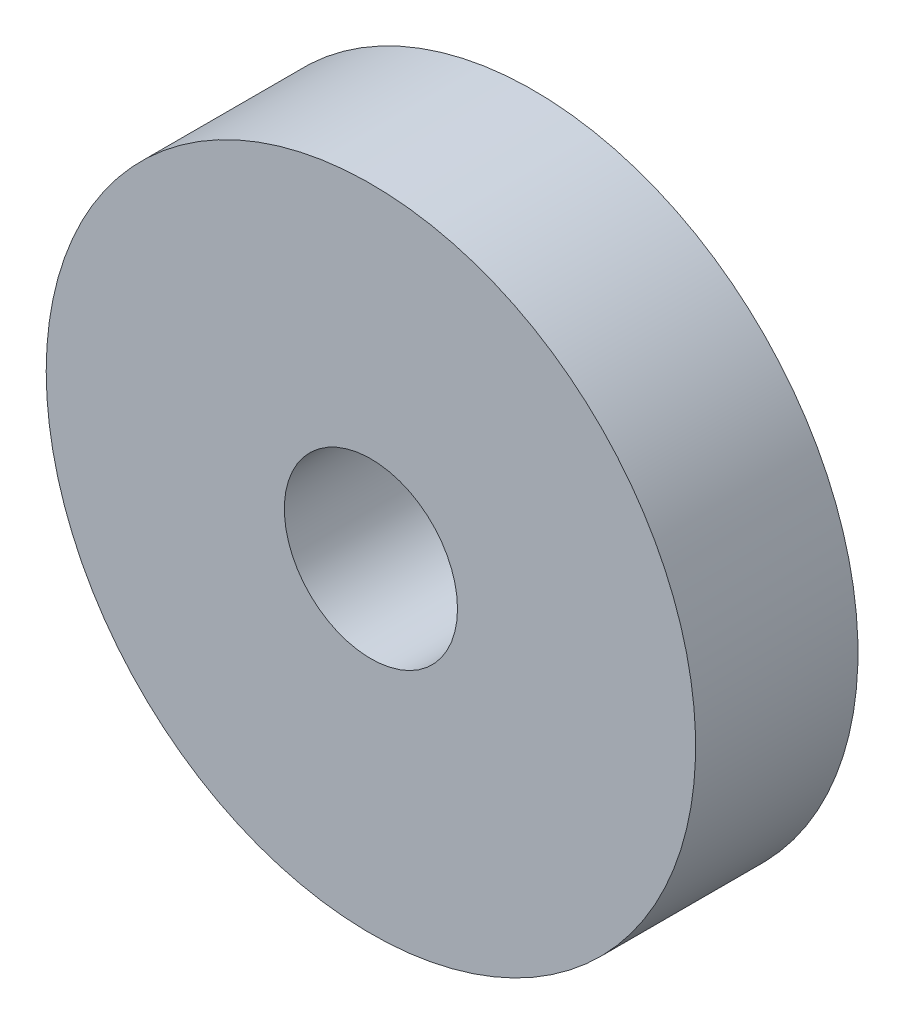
ISO-10303-21;
HEADER;
FILE_DESCRIPTION(('STEP AP214'),'2;1');
FILE_NAME('part.step','',(''),(''),'','','');
FILE_SCHEMA(('AUTOMOTIVE_DESIGN { 1 0 10303 214 1 1 1 1 }'));
ENDSEC;
DATA;
#1=APPLICATION_CONTEXT('core data for automotive mechanical design processes');
#2=APPLICATION_PROTOCOL_DEFINITION('international standard','automotive_design',2000,#1);
#3=PRODUCT_CONTEXT('',#1,'mechanical');
#4=PRODUCT('Part','Part','',(#3));
#5=PRODUCT_RELATED_PRODUCT_CATEGORY('part','',(#4));
#6=PRODUCT_DEFINITION_FORMATION('','',#4);
#7=PRODUCT_DEFINITION_CONTEXT('part definition',#1,'design');
#8=PRODUCT_DEFINITION('design','',#6,#7);
#9=PRODUCT_DEFINITION_SHAPE('','',#8);
#10=(LENGTH_UNIT() NAMED_UNIT(*) SI_UNIT(.MILLI.,.METRE.));
#11=(NAMED_UNIT(*) PLANE_ANGLE_UNIT() SI_UNIT($,.RADIAN.));
#12=(NAMED_UNIT(*) SI_UNIT($,.STERADIAN.) SOLID_ANGLE_UNIT());
#13=UNCERTAINTY_MEASURE_WITH_UNIT(LENGTH_MEASURE(1.E-05),#10,'distance_accuracy_value','');
#14=(GEOMETRIC_REPRESENTATION_CONTEXT(3) GLOBAL_UNCERTAINTY_ASSIGNED_CONTEXT((#13)) GLOBAL_UNIT_ASSIGNED_CONTEXT((#10,
#11,#12)) REPRESENTATION_CONTEXT('',''));
#15=CARTESIAN_POINT('',(0.,0.,0.));
#16=DIRECTION('',(0.,0.,1.));
#17=DIRECTION('',(1.,0.,0.));
#18=AXIS2_PLACEMENT_3D('',#15,#16,#17);
#19=CARTESIAN_POINT('',(0.,0.,4.7625));
#20=DIRECTION('',(0.,0.,-1.));
#21=DIRECTION('',(-1.,0.,0.));
#22=AXIS2_PLACEMENT_3D('',#19,#20,#21);
#23=CYLINDRICAL_SURFACE('',#22,9.525);
#24=CARTESIAN_POINT('',(0.,0.,4.7625));
#25=DIRECTION('',(0.,0.,1.));
#26=DIRECTION('',(1.,0.,0.));
#27=AXIS2_PLACEMENT_3D('',#24,#25,#26);
#28=CIRCLE('',#27,9.525);
#29=CARTESIAN_POINT('',(-9.525,0.,4.7625));
#30=VERTEX_POINT('',#29);
#31=EDGE_CURVE('E10',#30,#30,#28,.T.);
#32=CARTESIAN_POINT('',(0.,0.,0.));
#33=DIRECTION('',(0.,0.,1.));
#34=DIRECTION('',(1.,0.,0.));
#35=AXIS2_PLACEMENT_3D('',#32,#33,#34);
#36=CIRCLE('',#35,9.525);
#37=CARTESIAN_POINT('',(-9.525,0.,0.));
#38=VERTEX_POINT('',#37);
#39=EDGE_CURVE('E40',#38,#38,#36,.T.);
#40=CARTESIAN_POINT('',(-9.525,0.,4.7625));
#41=CARTESIAN_POINT('',(-9.525,0.,4.712890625));
#42=CARTESIAN_POINT('',(-9.525,0.,4.66328125));
#43=CARTESIAN_POINT('',(-9.525,0.,4.5640625));
#44=CARTESIAN_POINT('',(-9.525,0.,4.514453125));
#45=CARTESIAN_POINT('',(-9.525,0.,4.415234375));
#46=CARTESIAN_POINT('',(-9.525,0.,4.365625));
#47=CARTESIAN_POINT('',(-9.525,0.,4.26640625));
#48=CARTESIAN_POINT('',(-9.525,0.,4.216796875));
#49=CARTESIAN_POINT('',(-9.525,0.,4.117578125));
#50=CARTESIAN_POINT('',(-9.525,0.,4.06796875));
#51=CARTESIAN_POINT('',(-9.525,0.,3.96875));
#52=CARTESIAN_POINT('',(-9.525,0.,3.919140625));
#53=CARTESIAN_POINT('',(-9.525,0.,3.819921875));
#54=CARTESIAN_POINT('',(-9.525,0.,3.7703125));
#55=CARTESIAN_POINT('',(-9.525,0.,3.67109375));
#56=CARTESIAN_POINT('',(-9.525,0.,3.621484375));
#57=CARTESIAN_POINT('',(-9.525,0.,3.522265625));
#58=CARTESIAN_POINT('',(-9.525,0.,3.47265625));
#59=CARTESIAN_POINT('',(-9.525,0.,3.3734375));
#60=CARTESIAN_POINT('',(-9.525,0.,3.323828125));
#61=CARTESIAN_POINT('',(-9.525,0.,3.224609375));
#62=CARTESIAN_POINT('',(-9.525,0.,3.175));
#63=CARTESIAN_POINT('',(-9.525,0.,3.07578125));
#64=CARTESIAN_POINT('',(-9.525,0.,3.026171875));
#65=CARTESIAN_POINT('',(-9.525,0.,2.926953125));
#66=CARTESIAN_POINT('',(-9.525,0.,2.87734375));
#67=CARTESIAN_POINT('',(-9.525,0.,2.778125));
#68=CARTESIAN_POINT('',(-9.525,0.,2.728515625));
#69=CARTESIAN_POINT('',(-9.525,0.,2.629296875));
#70=CARTESIAN_POINT('',(-9.525,0.,2.5796875));
#71=CARTESIAN_POINT('',(-9.525,0.,2.48046875));
#72=CARTESIAN_POINT('',(-9.525,0.,2.430859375));
#73=CARTESIAN_POINT('',(-9.525,0.,2.331640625));
#74=CARTESIAN_POINT('',(-9.525,0.,2.28203125));
#75=CARTESIAN_POINT('',(-9.525,0.,2.1828125));
#76=CARTESIAN_POINT('',(-9.525,0.,2.133203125));
#77=CARTESIAN_POINT('',(-9.525,0.,2.033984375));
#78=CARTESIAN_POINT('',(-9.525,0.,1.984375));
#79=CARTESIAN_POINT('',(-9.525,0.,1.88515625));
#80=CARTESIAN_POINT('',(-9.525,0.,1.835546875));
#81=CARTESIAN_POINT('',(-9.525,0.,1.736328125));
#82=CARTESIAN_POINT('',(-9.525,0.,1.68671875));
#83=CARTESIAN_POINT('',(-9.525,0.,1.5875));
#84=CARTESIAN_POINT('',(-9.525,0.,1.537890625));
#85=CARTESIAN_POINT('',(-9.525,0.,1.438671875));
#86=CARTESIAN_POINT('',(-9.525,0.,1.3890625));
#87=CARTESIAN_POINT('',(-9.525,0.,1.28984375));
#88=CARTESIAN_POINT('',(-9.525,0.,1.240234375));
#89=CARTESIAN_POINT('',(-9.525,0.,1.141015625));
#90=CARTESIAN_POINT('',(-9.525,0.,1.09140625));
#91=CARTESIAN_POINT('',(-9.525,0.,0.992187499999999));
#92=CARTESIAN_POINT('',(-9.525,0.,0.942578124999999));
#93=CARTESIAN_POINT('',(-9.525,0.,0.843359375));
#94=CARTESIAN_POINT('',(-9.525,0.,0.79375));
#95=CARTESIAN_POINT('',(-9.525,0.,0.69453125));
#96=CARTESIAN_POINT('',(-9.525,0.,0.644921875));
#97=CARTESIAN_POINT('',(-9.525,0.,0.545703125));
#98=CARTESIAN_POINT('',(-9.525,0.,0.49609375));
#99=CARTESIAN_POINT('',(-9.525,0.,0.396875));
#100=CARTESIAN_POINT('',(-9.525,0.,0.347265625));
#101=CARTESIAN_POINT('',(-9.525,0.,0.248046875));
#102=CARTESIAN_POINT('',(-9.525,0.,0.1984375));
#103=CARTESIAN_POINT('',(-9.525,0.,0.09921875));
#104=CARTESIAN_POINT('',(-9.525,0.,0.049609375));
#105=CARTESIAN_POINT('',(-9.525,0.,0.));
#106=B_SPLINE_CURVE_WITH_KNOTS('',3,(#40,#41,#42,#43,#44,#45,#46,#47,#48,#49,#50,#51,#52,#53,
#54,#55,#56,#57,#58,#59,#60,#61,#62,#63,#64,#65,#66,#67,#68,#69,#70,#71,#72,#73,#74,#75,#76,#77,
#78,#79,#80,#81,#82,#83,#84,#85,#86,#87,#88,#89,#90,#91,#92,#93,#94,#95,#96,#97,#98,#99,#100,
#101,#102,#103,#104,#105),.UNSPECIFIED.,.F.,.F.,(4,2,2,2,2,2,2,2,2,2,2,2,2,2,2,2,2,2,2,2,2,2,2,
2,2,2,2,2,2,2,2,2,4),(0.,0.148828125,0.29765625,0.446484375,0.5953125,0.744140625,
0.892968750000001,1.041796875,1.190625,1.339453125,1.48828125,1.637109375,1.7859375,1.934765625,
2.08359375,2.232421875,2.38125,2.530078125,2.67890625,2.827734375,2.9765625,3.125390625,
3.27421875,3.423046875,3.571875,3.720703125,3.86953125,4.018359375,4.1671875,4.316015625,
4.46484375,4.613671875,4.7625),.UNSPECIFIED.);
#107=EDGE_CURVE('BSEAM37',#30,#38,#106,.T.);
#108=ORIENTED_EDGE('',*,*,#31,.F.);
#109=ORIENTED_EDGE('',*,*,#39,.T.);
#110=ORIENTED_EDGE('',*,*,#107,.T.);
#111=ORIENTED_EDGE('',*,*,#107,.F.);
#112=EDGE_LOOP('',(#108,#110,#109,#111));
#113=FACE_BOUND('',#112,.T.);
#114=ADVANCED_FACE('F37',(#113),#23,.T.);
#115=CARTESIAN_POINT('',(0.,0.,4.7625));
#116=DIRECTION('',(0.,0.,1.));
#117=DIRECTION('',(1.,0.,0.));
#118=AXIS2_PLACEMENT_3D('',#115,#116,#117);
#119=PLANE('',#118);
#120=CARTESIAN_POINT('',(0.,0.,4.7625));
#121=DIRECTION('',(0.,0.,1.));
#122=DIRECTION('',(1.,0.,0.));
#123=AXIS2_PLACEMENT_3D('',#120,#121,#122);
#124=CIRCLE('',#123,2.54);
#125=CARTESIAN_POINT('',(2.54,0.,4.7625));
#126=VERTEX_POINT('',#125);
#127=EDGE_CURVE('E49',#126,#126,#124,.T.);
#128=ORIENTED_EDGE('',*,*,#127,.F.);
#129=EDGE_LOOP('',(#128));
#130=FACE_BOUND('',#129,.T.);
#131=ORIENTED_EDGE('',*,*,#31,.T.);
#132=EDGE_LOOP('',(#131));
#133=FACE_BOUND('',#132,.T.);
#134=ADVANCED_FACE('F64',(#130,#133),#119,.T.);
#135=CARTESIAN_POINT('',(0.,0.,0.));
#136=DIRECTION('',(0.,0.,1.));
#137=DIRECTION('',(1.,0.,0.));
#138=AXIS2_PLACEMENT_3D('',#135,#136,#137);
#139=PLANE('',#138);
#140=CARTESIAN_POINT('',(0.,0.,0.));
#141=DIRECTION('',(0.,0.,1.));
#142=DIRECTION('',(1.,0.,0.));
#143=AXIS2_PLACEMENT_3D('',#140,#141,#142);
#144=CIRCLE('',#143,2.54);
#145=CARTESIAN_POINT('',(2.54,0.,0.));
#146=VERTEX_POINT('',#145);
#147=EDGE_CURVE('E47',#146,#146,#144,.T.);
#148=ORIENTED_EDGE('',*,*,#147,.T.);
#149=EDGE_LOOP('',(#148));
#150=FACE_BOUND('',#149,.T.);
#151=ORIENTED_EDGE('',*,*,#39,.F.);
#152=EDGE_LOOP('',(#151));
#153=FACE_BOUND('',#152,.T.);
#154=ADVANCED_FACE('F55',(#150,#153),#139,.F.);
#155=CARTESIAN_POINT('',(0.,0.,0.));
#156=DIRECTION('',(0.,0.,1.));
#157=DIRECTION('',(1.,0.,0.));
#158=AXIS2_PLACEMENT_3D('',#155,#156,#157);
#159=CYLINDRICAL_SURFACE('',#158,2.54);
#160=CARTESIAN_POINT('',(2.54,0.,0.));
#161=CARTESIAN_POINT('',(2.54,0.,0.049609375));
#162=CARTESIAN_POINT('',(2.54,0.,0.09921875));
#163=CARTESIAN_POINT('',(2.54,0.,0.1984375));
#164=CARTESIAN_POINT('',(2.54,0.,0.248046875));
#165=CARTESIAN_POINT('',(2.54,0.,0.347265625));
#166=CARTESIAN_POINT('',(2.54,0.,0.396875));
#167=CARTESIAN_POINT('',(2.54,0.,0.49609375));
#168=CARTESIAN_POINT('',(2.54,0.,0.545703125));
#169=CARTESIAN_POINT('',(2.54,0.,0.644921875));
#170=CARTESIAN_POINT('',(2.54,0.,0.69453125));
#171=CARTESIAN_POINT('',(2.54,0.,0.79375));
#172=CARTESIAN_POINT('',(2.54,0.,0.843359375));
#173=CARTESIAN_POINT('',(2.54,0.,0.942578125));
#174=CARTESIAN_POINT('',(2.54,0.,0.9921875));
#175=CARTESIAN_POINT('',(2.54,0.,1.09140625));
#176=CARTESIAN_POINT('',(2.54,0.,1.141015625));
#177=CARTESIAN_POINT('',(2.54,0.,1.240234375));
#178=CARTESIAN_POINT('',(2.54,0.,1.28984375));
#179=CARTESIAN_POINT('',(2.54,0.,1.3890625));
#180=CARTESIAN_POINT('',(2.54,0.,1.438671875));
#181=CARTESIAN_POINT('',(2.54,0.,1.537890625));
#182=CARTESIAN_POINT('',(2.54,0.,1.5875));
#183=CARTESIAN_POINT('',(2.54,0.,1.68671875));
#184=CARTESIAN_POINT('',(2.54,0.,1.736328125));
#185=CARTESIAN_POINT('',(2.54,0.,1.835546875));
#186=CARTESIAN_POINT('',(2.54,0.,1.88515625));
#187=CARTESIAN_POINT('',(2.54,0.,1.984375));
#188=CARTESIAN_POINT('',(2.54,0.,2.033984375));
#189=CARTESIAN_POINT('',(2.54,0.,2.133203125));
#190=CARTESIAN_POINT('',(2.54,0.,2.1828125));
#191=CARTESIAN_POINT('',(2.54,0.,2.28203125));
#192=CARTESIAN_POINT('',(2.54,0.,2.331640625));
#193=CARTESIAN_POINT('',(2.54,0.,2.430859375));
#194=CARTESIAN_POINT('',(2.54,0.,2.48046875));
#195=CARTESIAN_POINT('',(2.54,0.,2.5796875));
#196=CARTESIAN_POINT('',(2.54,0.,2.629296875));
#197=CARTESIAN_POINT('',(2.54,0.,2.728515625));
#198=CARTESIAN_POINT('',(2.54,0.,2.778125));
#199=CARTESIAN_POINT('',(2.54,0.,2.87734375));
#200=CARTESIAN_POINT('',(2.54,0.,2.926953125));
#201=CARTESIAN_POINT('',(2.54,0.,3.026171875));
#202=CARTESIAN_POINT('',(2.54,0.,3.07578125));
#203=CARTESIAN_POINT('',(2.54,0.,3.175));
#204=CARTESIAN_POINT('',(2.54,0.,3.224609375));
#205=CARTESIAN_POINT('',(2.54,0.,3.323828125));
#206=CARTESIAN_POINT('',(2.54,0.,3.3734375));
#207=CARTESIAN_POINT('',(2.54,0.,3.47265625));
#208=CARTESIAN_POINT('',(2.54,0.,3.522265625));
#209=CARTESIAN_POINT('',(2.54,0.,3.621484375));
#210=CARTESIAN_POINT('',(2.54,0.,3.67109375));
#211=CARTESIAN_POINT('',(2.54,0.,3.7703125));
#212=CARTESIAN_POINT('',(2.54,0.,3.819921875));
#213=CARTESIAN_POINT('',(2.54,0.,3.919140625));
#214=CARTESIAN_POINT('',(2.54,0.,3.96875));
#215=CARTESIAN_POINT('',(2.54,0.,4.06796875));
#216=CARTESIAN_POINT('',(2.54,0.,4.117578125));
#217=CARTESIAN_POINT('',(2.54,0.,4.216796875));
#218=CARTESIAN_POINT('',(2.54,0.,4.26640625));
#219=CARTESIAN_POINT('',(2.54,0.,4.365625));
#220=CARTESIAN_POINT('',(2.54,0.,4.415234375));
#221=CARTESIAN_POINT('',(2.54,0.,4.514453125));
#222=CARTESIAN_POINT('',(2.54,0.,4.5640625));
#223=CARTESIAN_POINT('',(2.54,0.,4.66328125));
#224=CARTESIAN_POINT('',(2.54,0.,4.712890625));
#225=CARTESIAN_POINT('',(2.54,0.,4.7625));
#226=B_SPLINE_CURVE_WITH_KNOTS('',3,(#160,#161,#162,#163,#164,#165,#166,#167,#168,#169,#170,
#171,#172,#173,#174,#175,#176,#177,#178,#179,#180,#181,#182,#183,#184,#185,#186,#187,#188,#189,
#190,#191,#192,#193,#194,#195,#196,#197,#198,#199,#200,#201,#202,#203,#204,#205,#206,#207,#208,
#209,#210,#211,#212,#213,#214,#215,#216,#217,#218,#219,#220,#221,#222,#223,#224,#225),
.UNSPECIFIED.,.F.,.F.,(4,2,2,2,2,2,2,2,2,2,2,2,2,2,2,2,2,2,2,2,2,2,2,2,2,2,2,2,2,2,2,2,4),(0.,
0.148828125,0.29765625,0.446484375,0.5953125,0.744140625,0.89296875,1.041796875,1.190625,
1.339453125,1.48828125,1.637109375,1.7859375,1.934765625,2.08359375,2.232421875,2.38125,
2.530078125,2.67890625,2.827734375,2.9765625,3.125390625,3.27421875,3.423046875,3.571875,
3.720703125,3.86953125,4.018359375,4.1671875,4.316015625,4.46484375,4.613671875,4.7625),.UNSPECIFIED.);
#227=EDGE_CURVE('BSEAM58',#146,#126,#226,.T.);
#228=ORIENTED_EDGE('',*,*,#147,.F.);
#229=ORIENTED_EDGE('',*,*,#127,.T.);
#230=ORIENTED_EDGE('',*,*,#227,.T.);
#231=ORIENTED_EDGE('',*,*,#227,.F.);
#232=EDGE_LOOP('',(#228,#230,#229,#231));
#233=FACE_BOUND('',#232,.T.);
#234=ADVANCED_FACE('F58',(#233),#159,.F.);
#235=CLOSED_SHELL('',(#114,#134,#154,#234));
#236=MANIFOLD_SOLID_BREP('B2',#235);
#237=ADVANCED_BREP_SHAPE_REPRESENTATION('',(#18,#236),#14);
#238=SHAPE_DEFINITION_REPRESENTATION(#9,#237);
ENDSEC;
END-ISO-10303-21;
